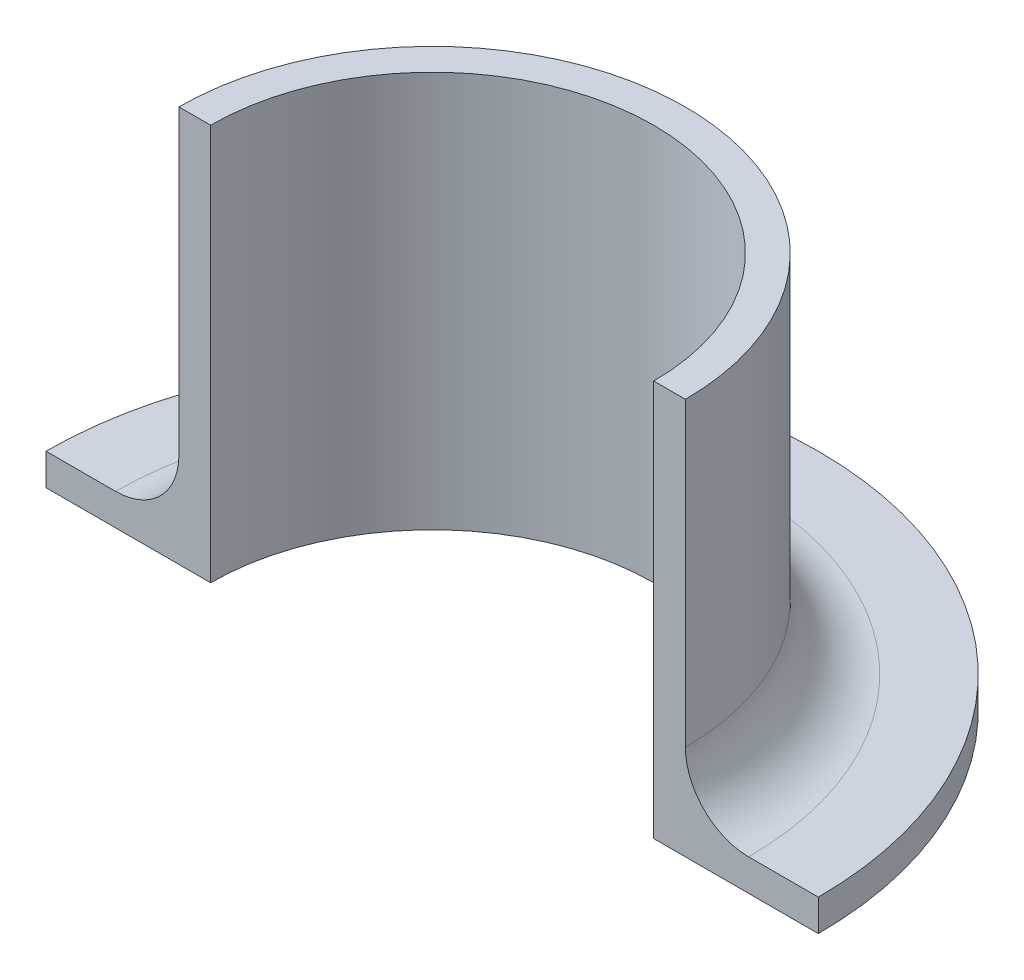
ISO-10303-21;
HEADER;
FILE_DESCRIPTION(('STEP AP214'),'2;1');
FILE_NAME('part.step','',(''),(''),'','','');
FILE_SCHEMA(('AUTOMOTIVE_DESIGN { 1 0 10303 214 1 1 1 1 }'));
ENDSEC;
DATA;
#1=APPLICATION_CONTEXT('core data for automotive mechanical design processes');
#2=APPLICATION_PROTOCOL_DEFINITION('international standard','automotive_design',2000,#1);
#3=PRODUCT_CONTEXT('',#1,'mechanical');
#4=PRODUCT('Part','Part','',(#3));
#5=PRODUCT_RELATED_PRODUCT_CATEGORY('part','',(#4));
#6=PRODUCT_DEFINITION_FORMATION('','',#4);
#7=PRODUCT_DEFINITION_CONTEXT('part definition',#1,'design');
#8=PRODUCT_DEFINITION('design','',#6,#7);
#9=PRODUCT_DEFINITION_SHAPE('','',#8);
#10=(LENGTH_UNIT() NAMED_UNIT(*) SI_UNIT(.MILLI.,.METRE.));
#11=(NAMED_UNIT(*) PLANE_ANGLE_UNIT() SI_UNIT($,.RADIAN.));
#12=(NAMED_UNIT(*) SI_UNIT($,.STERADIAN.) SOLID_ANGLE_UNIT());
#13=UNCERTAINTY_MEASURE_WITH_UNIT(LENGTH_MEASURE(1.E-05),#10,'distance_accuracy_value','');
#14=(GEOMETRIC_REPRESENTATION_CONTEXT(3) GLOBAL_UNCERTAINTY_ASSIGNED_CONTEXT((#13)) GLOBAL_UNIT_ASSIGNED_CONTEXT((#10,
#11,#12)) REPRESENTATION_CONTEXT('',''));
#15=CARTESIAN_POINT('',(0.,0.,0.));
#16=DIRECTION('',(0.,0.,1.));
#17=DIRECTION('',(1.,0.,0.));
#18=AXIS2_PLACEMENT_3D('',#15,#16,#17);
#19=CARTESIAN_POINT('',(22.225,17.1893734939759,1.55196345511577E-13));
#20=DIRECTION('',(0.,1.,0.));
#21=DIRECTION('',(0.,0.,1.));
#22=AXIS2_PLACEMENT_3D('',#19,#20,#21);
#23=PLANE('',#22);
#24=CARTESIAN_POINT('',(0.,17.1893734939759,0.));
#25=DIRECTION('',(0.,1.,0.));
#26=DIRECTION('',(0.,0.,1.));
#27=AXIS2_PLACEMENT_3D('',#24,#25,#26);
#28=CIRCLE('',#27,25.4);
#29=CARTESIAN_POINT('',(25.4,17.1893734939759,1.77367252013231E-13));
#30=VERTEX_POINT('',#29);
#31=CARTESIAN_POINT('',(-25.4,17.1893734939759,0.));
#32=VERTEX_POINT('',#31);
#33=EDGE_CURVE('E11',#30,#32,#28,.T.);
#34=ORIENTED_EDGE('',*,*,#33,.T.);
#35=DIRECTION('',(-1.,0.,0.));
#36=VECTOR('',#35,1.);
#37=CARTESIAN_POINT('',(-22.225,17.1893734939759,0.));
#38=LINE('',#37,#36);
#39=CARTESIAN_POINT('',(-22.225,17.1893734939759,0.));
#40=VERTEX_POINT('',#39);
#41=EDGE_CURVE('E90',#40,#32,#38,.T.);
#42=ORIENTED_EDGE('',*,*,#41,.F.);
#43=CARTESIAN_POINT('',(0.,17.1893734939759,0.));
#44=DIRECTION('',(0.,1.,0.));
#45=DIRECTION('',(0.,0.,1.));
#46=AXIS2_PLACEMENT_3D('',#43,#44,#45);
#47=CIRCLE('',#46,22.225);
#48=CARTESIAN_POINT('',(22.225,17.1893734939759,1.55196345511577E-13));
#49=VERTEX_POINT('',#48);
#50=EDGE_CURVE('E47',#49,#40,#47,.T.);
#51=ORIENTED_EDGE('',*,*,#50,.F.);
#52=DIRECTION('',(1.,0.,0.));
#53=VECTOR('',#52,1.);
#54=CARTESIAN_POINT('',(22.225,17.1893734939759,1.55196345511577E-13));
#55=LINE('',#54,#53);
#56=EDGE_CURVE('E92',#49,#30,#55,.T.);
#57=ORIENTED_EDGE('',*,*,#56,.T.);
#58=EDGE_LOOP('',(#34,#42,#51,#57));
#59=FACE_BOUND('',#58,.T.);
#60=ADVANCED_FACE('F32',(#59),#23,.T.);
#61=CARTESIAN_POINT('',(0.,41.9157911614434,0.));
#62=DIRECTION('',(0.,1.,0.));
#63=DIRECTION('',(0.,0.,1.));
#64=AXIS2_PLACEMENT_3D('',#61,#62,#63);
#65=CYLINDRICAL_SURFACE('',#64,25.4);
#66=CARTESIAN_POINT('',(0.,-13.0366265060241,0.));
#67=DIRECTION('',(0.,1.,0.));
#68=DIRECTION('',(0.,0.,1.));
#69=AXIS2_PLACEMENT_3D('',#66,#67,#68);
#70=CIRCLE('',#69,25.4);
#71=CARTESIAN_POINT('',(25.4,-13.0366265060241,1.77367252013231E-13));
#72=VERTEX_POINT('',#71);
#73=CARTESIAN_POINT('',(-25.4,-13.0366265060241,0.));
#74=VERTEX_POINT('',#73);
#75=EDGE_CURVE('E40',#72,#74,#70,.T.);
#76=ORIENTED_EDGE('',*,*,#75,.T.);
#77=DIRECTION('',(0.,-1.,0.));
#78=VECTOR('',#77,1.);
#79=CARTESIAN_POINT('',(-25.4,-13.036626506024,0.));
#80=LINE('',#79,#78);
#81=EDGE_CURVE('E101',#32,#74,#80,.T.);
#82=ORIENTED_EDGE('',*,*,#81,.F.);
#83=ORIENTED_EDGE('',*,*,#33,.F.);
#84=DIRECTION('',(0.,-1.,0.));
#85=VECTOR('',#84,1.);
#86=CARTESIAN_POINT('',(25.4,-13.036626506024,1.77367252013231E-13));
#87=LINE('',#86,#85);
#88=EDGE_CURVE('E120',#30,#72,#87,.T.);
#89=ORIENTED_EDGE('',*,*,#88,.T.);
#90=EDGE_LOOP('',(#76,#82,#83,#89));
#91=FACE_BOUND('',#90,.T.);
#92=ADVANCED_FACE('F34',(#91),#65,.T.);
#93=CARTESIAN_POINT('',(0.,-13.0366265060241,0.));
#94=DIRECTION('',(0.,1.,0.));
#95=DIRECTION('',(0.,0.,1.));
#96=AXIS2_PLACEMENT_3D('',#93,#94,#95);
#97=TOROIDAL_SURFACE('',#96,31.75,6.35);
#98=CARTESIAN_POINT('',(0.,-19.3866265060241,0.));
#99=DIRECTION('',(0.,1.,0.));
#100=DIRECTION('',(0.,0.,1.));
#101=AXIS2_PLACEMENT_3D('',#98,#99,#100);
#102=CIRCLE('',#101,31.75);
#103=CARTESIAN_POINT('',(31.75,-19.3866265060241,2.21709065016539E-13));
#104=VERTEX_POINT('',#103);
#105=CARTESIAN_POINT('',(-31.75,-19.3866265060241,0.));
#106=VERTEX_POINT('',#105);
#107=EDGE_CURVE('E141',#104,#106,#102,.T.);
#108=ORIENTED_EDGE('',*,*,#107,.T.);
#109=CARTESIAN_POINT('',(-31.75,-13.0366265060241,0.));
#110=DIRECTION('',(0.,0.,-1.));
#111=DIRECTION('',(1.,0.,0.));
#112=AXIS2_PLACEMENT_3D('',#109,#110,#111);
#113=CIRCLE('',#112,6.35);
#114=EDGE_CURVE('E106',#74,#106,#113,.T.);
#115=ORIENTED_EDGE('',*,*,#114,.F.);
#116=ORIENTED_EDGE('',*,*,#75,.F.);
#117=CARTESIAN_POINT('',(31.75,-13.0366265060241,2.21709065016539E-13));
#118=DIRECTION('',(0.,0.,1.));
#119=DIRECTION('',(-1.,0.,0.));
#120=AXIS2_PLACEMENT_3D('',#117,#118,#119);
#121=CIRCLE('',#120,6.35);
#122=EDGE_CURVE('E122',#72,#104,#121,.T.);
#123=ORIENTED_EDGE('',*,*,#122,.T.);
#124=EDGE_LOOP('',(#108,#115,#116,#123));
#125=FACE_BOUND('',#124,.T.);
#126=ADVANCED_FACE('F143',(#125),#97,.F.);
#127=CARTESIAN_POINT('',(38.735,-19.3866265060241,2.70485059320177E-13));
#128=DIRECTION('',(0.,1.,0.));
#129=DIRECTION('',(0.,0.,1.));
#130=AXIS2_PLACEMENT_3D('',#127,#128,#129);
#131=PLANE('',#130);
#132=CARTESIAN_POINT('',(0.,-19.3866265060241,0.));
#133=DIRECTION('',(0.,1.,0.));
#134=DIRECTION('',(0.,0.,1.));
#135=AXIS2_PLACEMENT_3D('',#132,#133,#134);
#136=CIRCLE('',#135,38.735);
#137=CARTESIAN_POINT('',(38.735,-19.3866265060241,2.70485059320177E-13));
#138=VERTEX_POINT('',#137);
#139=CARTESIAN_POINT('',(-38.735,-19.3866265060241,0.));
#140=VERTEX_POINT('',#139);
#141=EDGE_CURVE('E139',#138,#140,#136,.T.);
#142=ORIENTED_EDGE('',*,*,#141,.T.);
#143=DIRECTION('',(-1.,0.,0.));
#144=VECTOR('',#143,1.);
#145=CARTESIAN_POINT('',(-38.735,-19.3866265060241,0.));
#146=LINE('',#145,#144);
#147=EDGE_CURVE('E108',#106,#140,#146,.T.);
#148=ORIENTED_EDGE('',*,*,#147,.F.);
#149=ORIENTED_EDGE('',*,*,#107,.F.);
#150=DIRECTION('',(1.,0.,0.));
#151=VECTOR('',#150,1.);
#152=CARTESIAN_POINT('',(38.735,-19.3866265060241,2.70485059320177E-13));
#153=LINE('',#152,#151);
#154=EDGE_CURVE('E125',#104,#138,#153,.T.);
#155=ORIENTED_EDGE('',*,*,#154,.T.);
#156=EDGE_LOOP('',(#142,#148,#149,#155));
#157=FACE_BOUND('',#156,.T.);
#158=ADVANCED_FACE('F149',(#157),#131,.T.);
#159=CARTESIAN_POINT('',(0.,41.9157911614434,0.));
#160=DIRECTION('',(0.,1.,0.));
#161=DIRECTION('',(0.,0.,1.));
#162=AXIS2_PLACEMENT_3D('',#159,#160,#161);
#163=CYLINDRICAL_SURFACE('',#162,38.735);
#164=CARTESIAN_POINT('',(0.,-22.5616265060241,0.));
#165=DIRECTION('',(0.,1.,0.));
#166=DIRECTION('',(0.,0.,1.));
#167=AXIS2_PLACEMENT_3D('',#164,#165,#166);
#168=CIRCLE('',#167,38.735);
#169=CARTESIAN_POINT('',(38.735,-22.5616265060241,2.70485059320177E-13));
#170=VERTEX_POINT('',#169);
#171=CARTESIAN_POINT('',(-38.735,-22.5616265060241,0.));
#172=VERTEX_POINT('',#171);
#173=EDGE_CURVE('E137',#170,#172,#168,.T.);
#174=ORIENTED_EDGE('',*,*,#173,.T.);
#175=DIRECTION('',(0.,-1.,0.));
#176=VECTOR('',#175,1.);
#177=CARTESIAN_POINT('',(-38.735,-22.5616265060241,0.));
#178=LINE('',#177,#176);
#179=EDGE_CURVE('E113',#140,#172,#178,.T.);
#180=ORIENTED_EDGE('',*,*,#179,.F.);
#181=ORIENTED_EDGE('',*,*,#141,.F.);
#182=DIRECTION('',(0.,-1.,0.));
#183=VECTOR('',#182,1.);
#184=CARTESIAN_POINT('',(38.735,-22.5616265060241,2.70485059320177E-13));
#185=LINE('',#184,#183);
#186=EDGE_CURVE('E128',#138,#170,#185,.T.);
#187=ORIENTED_EDGE('',*,*,#186,.T.);
#188=EDGE_LOOP('',(#174,#180,#181,#187));
#189=FACE_BOUND('',#188,.T.);
#190=ADVANCED_FACE('F152',(#189),#163,.T.);
#191=CARTESIAN_POINT('',(22.225,-22.5616265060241,1.55196345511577E-13));
#192=DIRECTION('',(0.,-1.,0.));
#193=DIRECTION('',(0.,0.,-1.));
#194=AXIS2_PLACEMENT_3D('',#191,#192,#193);
#195=PLANE('',#194);
#196=CARTESIAN_POINT('',(0.,-22.5616265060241,0.));
#197=DIRECTION('',(0.,1.,0.));
#198=DIRECTION('',(0.,0.,1.));
#199=AXIS2_PLACEMENT_3D('',#196,#197,#198);
#200=CIRCLE('',#199,22.225);
#201=CARTESIAN_POINT('',(22.225,-22.5616265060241,1.55196345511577E-13));
#202=VERTEX_POINT('',#201);
#203=CARTESIAN_POINT('',(-22.225,-22.5616265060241,0.));
#204=VERTEX_POINT('',#203);
#205=EDGE_CURVE('E55',#202,#204,#200,.T.);
#206=ORIENTED_EDGE('',*,*,#205,.T.);
#207=DIRECTION('',(1.,0.,0.));
#208=VECTOR('',#207,1.);
#209=CARTESIAN_POINT('',(-22.225,-22.5616265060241,0.));
#210=LINE('',#209,#208);
#211=EDGE_CURVE('E116',#172,#204,#210,.T.);
#212=ORIENTED_EDGE('',*,*,#211,.F.);
#213=ORIENTED_EDGE('',*,*,#173,.F.);
#214=DIRECTION('',(-1.,0.,0.));
#215=VECTOR('',#214,1.);
#216=CARTESIAN_POINT('',(22.225,-22.5616265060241,1.55196345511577E-13));
#217=LINE('',#216,#215);
#218=EDGE_CURVE('E131',#170,#202,#217,.T.);
#219=ORIENTED_EDGE('',*,*,#218,.T.);
#220=EDGE_LOOP('',(#206,#212,#213,#219));
#221=FACE_BOUND('',#220,.T.);
#222=ADVANCED_FACE('F156',(#221),#195,.T.);
#223=CARTESIAN_POINT('',(0.,41.9157911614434,0.));
#224=DIRECTION('',(0.,1.,0.));
#225=DIRECTION('',(0.,0.,1.));
#226=AXIS2_PLACEMENT_3D('',#223,#224,#225);
#227=CYLINDRICAL_SURFACE('',#226,22.225);
#228=DIRECTION('',(0.,1.,0.));
#229=VECTOR('',#228,1.);
#230=CARTESIAN_POINT('',(22.225,17.1893734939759,1.55196345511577E-13));
#231=LINE('',#230,#229);
#232=EDGE_CURVE('E133',#202,#49,#231,.T.);
#233=ORIENTED_EDGE('',*,*,#232,.T.);
#234=ORIENTED_EDGE('',*,*,#50,.T.);
#235=DIRECTION('',(0.,1.,0.));
#236=VECTOR('',#235,1.);
#237=CARTESIAN_POINT('',(-22.225,17.1893734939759,0.));
#238=LINE('',#237,#236);
#239=EDGE_CURVE('E104',#204,#40,#238,.T.);
#240=ORIENTED_EDGE('',*,*,#239,.F.);
#241=ORIENTED_EDGE('',*,*,#205,.F.);
#242=EDGE_LOOP('',(#233,#234,#240,#241));
#243=FACE_BOUND('',#242,.T.);
#244=ADVANCED_FACE('F160',(#243),#227,.F.);
#245=CARTESIAN_POINT('',(31.75,-13.0366265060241,2.21709065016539E-13));
#246=DIRECTION('',(0.,0.,-1.));
#247=DIRECTION('',(-1.,0.,0.));
#248=AXIS2_PLACEMENT_3D('',#245,#246,#247);
#249=PLANE('',#248);
#250=ORIENTED_EDGE('',*,*,#56,.F.);
#251=ORIENTED_EDGE('',*,*,#232,.F.);
#252=ORIENTED_EDGE('',*,*,#218,.F.);
#253=ORIENTED_EDGE('',*,*,#186,.F.);
#254=ORIENTED_EDGE('',*,*,#154,.F.);
#255=ORIENTED_EDGE('',*,*,#122,.F.);
#256=ORIENTED_EDGE('',*,*,#88,.F.);
#257=EDGE_LOOP('',(#250,#251,#252,#253,#254,#255,#256));
#258=FACE_BOUND('',#257,.T.);
#259=ADVANCED_FACE('F159',(#258),#249,.F.);
#260=CARTESIAN_POINT('',(-31.75,-13.0366265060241,0.));
#261=DIRECTION('',(0.,0.,1.));
#262=DIRECTION('',(1.,0.,0.));
#263=AXIS2_PLACEMENT_3D('',#260,#261,#262);
#264=PLANE('',#263);
#265=ORIENTED_EDGE('',*,*,#41,.T.);
#266=ORIENTED_EDGE('',*,*,#81,.T.);
#267=ORIENTED_EDGE('',*,*,#114,.T.);
#268=ORIENTED_EDGE('',*,*,#147,.T.);
#269=ORIENTED_EDGE('',*,*,#179,.T.);
#270=ORIENTED_EDGE('',*,*,#211,.T.);
#271=ORIENTED_EDGE('',*,*,#239,.T.);
#272=EDGE_LOOP('',(#265,#266,#267,#268,#269,#270,#271));
#273=FACE_BOUND('',#272,.T.);
#274=ADVANCED_FACE('F99',(#273),#264,.T.);
#275=CLOSED_SHELL('',(#60,#92,#126,#158,#190,#222,#244,#259,#274));
#276=MANIFOLD_SOLID_BREP('B2',#275);
#277=ADVANCED_BREP_SHAPE_REPRESENTATION('',(#18,#276),#14);
#278=SHAPE_DEFINITION_REPRESENTATION(#9,#277);
ENDSEC;
END-ISO-10303-21;
